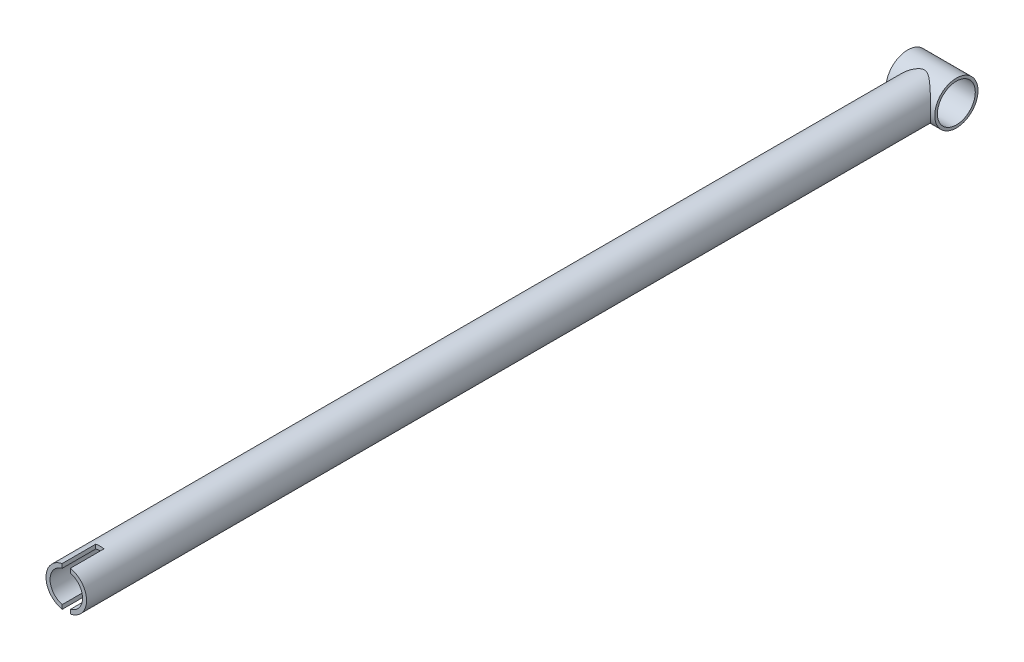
ISO-10303-21;
HEADER;
FILE_DESCRIPTION(('STEP AP214'),'2;1');
FILE_NAME('part.step','',(''),(''),'','','');
FILE_SCHEMA(('AUTOMOTIVE_DESIGN { 1 0 10303 214 1 1 1 1 }'));
ENDSEC;
DATA;
#1=APPLICATION_CONTEXT('core data for automotive mechanical design processes');
#2=APPLICATION_PROTOCOL_DEFINITION('international standard','automotive_design',2000,#1);
#3=PRODUCT_CONTEXT('',#1,'mechanical');
#4=PRODUCT('Part','Part','',(#3));
#5=PRODUCT_RELATED_PRODUCT_CATEGORY('part','',(#4));
#6=PRODUCT_DEFINITION_FORMATION('','',#4);
#7=PRODUCT_DEFINITION_CONTEXT('part definition',#1,'design');
#8=PRODUCT_DEFINITION('design','',#6,#7);
#9=PRODUCT_DEFINITION_SHAPE('','',#8);
#10=(LENGTH_UNIT() NAMED_UNIT(*) SI_UNIT(.MILLI.,.METRE.));
#11=(NAMED_UNIT(*) PLANE_ANGLE_UNIT() SI_UNIT($,.RADIAN.));
#12=(NAMED_UNIT(*) SI_UNIT($,.STERADIAN.) SOLID_ANGLE_UNIT());
#13=UNCERTAINTY_MEASURE_WITH_UNIT(LENGTH_MEASURE(1.E-05),#10,'distance_accuracy_value','');
#14=(GEOMETRIC_REPRESENTATION_CONTEXT(3) GLOBAL_UNCERTAINTY_ASSIGNED_CONTEXT((#13)) GLOBAL_UNIT_ASSIGNED_CONTEXT((#10,
#11,#12)) REPRESENTATION_CONTEXT('',''));
#15=CARTESIAN_POINT('',(0.,0.,0.));
#16=DIRECTION('',(0.,0.,1.));
#17=DIRECTION('',(1.,0.,0.));
#18=AXIS2_PLACEMENT_3D('',#15,#16,#17);
#19=CARTESIAN_POINT('',(0.,0.,1016.));
#20=DIRECTION('',(0.,0.,-1.));
#21=DIRECTION('',(-1.,0.,0.));
#22=AXIS2_PLACEMENT_3D('',#19,#20,#21);
#23=CYLINDRICAL_SURFACE('',#22,23.8125);
#24=CARTESIAN_POINT('',(0.,0.,976.63));
#25=DIRECTION('',(0.,0.,-1.));
#26=DIRECTION('',(-1.,0.,0.));
#27=AXIS2_PLACEMENT_3D('',#24,#25,#26);
#28=CIRCLE('',#27,23.8125);
#29=CARTESIAN_POINT('',(4.826,-23.3183378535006,976.63));
#30=VERTEX_POINT('',#29);
#31=CARTESIAN_POINT('',(-4.826,-23.3183378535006,976.63));
#32=VERTEX_POINT('',#31);
#33=EDGE_CURVE('E98',#30,#32,#28,.T.);
#34=ORIENTED_EDGE('',*,*,#33,.T.);
#35=DIRECTION('',(0.,0.,-1.));
#36=VECTOR('',#35,1.);
#37=CARTESIAN_POINT('',(-4.826,-23.3183378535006,1016.));
#38=LINE('',#37,#36);
#39=CARTESIAN_POINT('',(-4.826,-23.3183378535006,1016.));
#40=VERTEX_POINT('',#39);
#41=EDGE_CURVE('E128',#32,#40,#38,.F.);
#42=ORIENTED_EDGE('',*,*,#41,.T.);
#43=CARTESIAN_POINT('',(0.,0.,1016.));
#44=DIRECTION('',(0.,0.,1.));
#45=DIRECTION('',(1.,0.,0.));
#46=AXIS2_PLACEMENT_3D('',#43,#44,#45);
#47=CIRCLE('',#46,23.8125);
#48=CARTESIAN_POINT('',(-4.826,23.3183378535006,1016.));
#49=VERTEX_POINT('',#48);
#50=EDGE_CURVE('E139',#49,#40,#47,.T.);
#51=ORIENTED_EDGE('',*,*,#50,.F.);
#52=DIRECTION('',(0.,0.,-1.));
#53=VECTOR('',#52,1.);
#54=CARTESIAN_POINT('',(-4.826,23.3183378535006,1016.));
#55=LINE('',#54,#53);
#56=CARTESIAN_POINT('',(-4.826,23.3183378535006,976.63));
#57=VERTEX_POINT('',#56);
#58=EDGE_CURVE('E131',#49,#57,#55,.T.);
#59=ORIENTED_EDGE('',*,*,#58,.T.);
#60=CARTESIAN_POINT('',(4.826,23.3183378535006,976.63));
#61=VERTEX_POINT('',#60);
#62=EDGE_CURVE('E108',#57,#61,#28,.T.);
#63=ORIENTED_EDGE('',*,*,#62,.T.);
#64=DIRECTION('',(0.,0.,-1.));
#65=VECTOR('',#64,1.);
#66=CARTESIAN_POINT('',(4.826,23.3183378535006,1016.));
#67=LINE('',#66,#65);
#68=CARTESIAN_POINT('',(4.826,23.3183378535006,1016.));
#69=VERTEX_POINT('',#68);
#70=EDGE_CURVE('E121',#61,#69,#67,.F.);
#71=ORIENTED_EDGE('',*,*,#70,.T.);
#72=CARTESIAN_POINT('',(4.826,-23.3183378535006,1016.));
#73=VERTEX_POINT('',#72);
#74=EDGE_CURVE('E119',#73,#69,#47,.T.);
#75=ORIENTED_EDGE('',*,*,#74,.F.);
#76=DIRECTION('',(0.,0.,-1.));
#77=VECTOR('',#76,1.);
#78=CARTESIAN_POINT('',(4.826,-23.3183378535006,1016.));
#79=LINE('',#78,#77);
#80=EDGE_CURVE('E109',#73,#30,#79,.T.);
#81=ORIENTED_EDGE('',*,*,#80,.T.);
#82=EDGE_LOOP('',(#34,#42,#51,#59,#63,#71,#75,#81));
#83=FACE_BOUND('',#82,.T.);
#84=CARTESIAN_POINT('',(-23.8125,0.,25.4));
#85=CARTESIAN_POINT('',(-23.8124945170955,0.5433699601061,25.3999945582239));
#86=CARTESIAN_POINT('',(-23.7938585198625,1.08695240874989,25.3825210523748));
#87=CARTESIAN_POINT('',(-23.7196691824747,2.16962719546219,25.3129885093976));
#88=CARTESIAN_POINT('',(-23.6640891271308,2.70871599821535,25.2609044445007));
#89=CARTESIAN_POINT('',(-23.5169409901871,3.77904353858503,25.1231106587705));
#90=CARTESIAN_POINT('',(-23.4252799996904,4.31025830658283,25.0373141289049));
#91=CARTESIAN_POINT('',(-23.2077627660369,5.35927877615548,24.8339205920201));
#92=CARTESIAN_POINT('',(-23.0819119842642,5.8770866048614,24.7163286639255));
#93=CARTESIAN_POINT('',(-22.7992557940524,6.89237236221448,24.4525734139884));
#94=CARTESIAN_POINT('',(-22.6426810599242,7.38997032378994,24.306623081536));
#95=CARTESIAN_POINT('',(-22.3004255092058,8.36622835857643,23.9881199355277));
#96=CARTESIAN_POINT('',(-22.1147441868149,8.84488810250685,23.8155666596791));
#97=CARTESIAN_POINT('',(-21.7168943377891,9.78111762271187,23.4465948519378));
#98=CARTESIAN_POINT('',(-21.5047407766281,10.2386991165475,23.2501898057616));
#99=CARTESIAN_POINT('',(-21.0562452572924,11.1319137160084,22.8360001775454));
#100=CARTESIAN_POINT('',(-20.8198977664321,11.5675417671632,22.6182107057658));
#101=CARTESIAN_POINT('',(-20.398848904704,12.2898845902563,22.2313557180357));
#102=CARTESIAN_POINT('',(-20.2196596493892,12.5823965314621,22.0670329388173));
#103=CARTESIAN_POINT('',(-19.8512712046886,13.1559236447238,21.7299860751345));
#104=CARTESIAN_POINT('',(-19.662074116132,13.4369412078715,21.5572637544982));
#105=CARTESIAN_POINT('',(-19.0802863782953,14.262943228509,21.0275146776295));
#106=CARTESIAN_POINT('',(-18.6735737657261,14.7907501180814,20.6589744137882));
#107=CARTESIAN_POINT('',(-17.826255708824,15.8017829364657,19.8963819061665));
#108=CARTESIAN_POINT('',(-17.3855514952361,16.2848692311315,19.5022558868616));
#109=CARTESIAN_POINT('',(-16.4750079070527,17.205474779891,18.6950850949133));
#110=CARTESIAN_POINT('',(-16.0051714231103,17.6429985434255,18.2820422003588));
#111=CARTESIAN_POINT('',(-15.2152157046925,18.3220124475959,17.595586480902));
#112=CARTESIAN_POINT('',(-14.9029540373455,18.5768229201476,17.3261612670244));
#113=CARTESIAN_POINT('',(-14.2681586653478,19.0687187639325,16.7832683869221));
#114=CARTESIAN_POINT('',(-13.9456253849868,19.3058048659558,16.5098008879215));
#115=CARTESIAN_POINT('',(-13.2902888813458,19.7626683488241,15.9600990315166));
#116=CARTESIAN_POINT('',(-12.9574780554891,19.9824324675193,15.6838627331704));
#117=CARTESIAN_POINT('',(-12.2818366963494,20.40466467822,15.1304583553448));
#118=CARTESIAN_POINT('',(-11.9390065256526,20.6071333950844,14.8532903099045));
#119=CARTESIAN_POINT('',(-11.2439339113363,20.9944518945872,14.3005791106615));
#120=CARTESIAN_POINT('',(-10.8917172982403,21.1793446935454,14.0250336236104));
#121=CARTESIAN_POINT('',(-10.1764303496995,21.532173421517,13.4770793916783));
#122=CARTESIAN_POINT('',(-9.81335887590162,21.7001075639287,13.2046709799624));
#123=CARTESIAN_POINT('',(-9.07584838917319,22.0187496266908,12.6661915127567));
#124=CARTESIAN_POINT('',(-8.70142284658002,22.1694770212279,12.400113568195));
#125=CARTESIAN_POINT('',(-7.93944983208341,22.4536333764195,11.877819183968));
#126=CARTESIAN_POINT('',(-7.55190632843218,22.5870675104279,11.6215998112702));
#127=CARTESIAN_POINT('',(-6.88132426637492,22.7983739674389,11.1996341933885));
#128=CARTESIAN_POINT('',(-6.60218570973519,22.8808339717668,11.0299903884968));
#129=CARTESIAN_POINT('',(-6.03568161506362,23.0367545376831,10.7005196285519));
#130=CARTESIAN_POINT('',(-5.7483160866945,23.110215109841,10.5406926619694));
#131=CARTESIAN_POINT('',(-5.16465858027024,23.2476063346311,10.2341091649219));
#132=CARTESIAN_POINT('',(-4.86837337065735,23.3115440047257,10.0873430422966));
#133=CARTESIAN_POINT('',(-4.26610720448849,23.4292506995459,9.81085060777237));
#134=CARTESIAN_POINT('',(-3.96012806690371,23.483021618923,9.68112112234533));
#135=CARTESIAN_POINT('',(-3.15568301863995,23.6077323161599,9.37423315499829));
#136=CARTESIAN_POINT('',(-2.64911932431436,23.6703713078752,9.21359493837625));
#137=CARTESIAN_POINT('',(-1.87405572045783,23.7400579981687,9.03182559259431));
#138=CARTESIAN_POINT('',(-1.61345016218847,23.7592340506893,8.98112306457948));
#139=CARTESIAN_POINT('',(-1.08834556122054,23.7890669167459,8.90180385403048));
#140=CARTESIAN_POINT('',(-0.823846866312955,23.7997244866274,8.87318521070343));
#141=CARTESIAN_POINT('',(-0.290962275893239,23.8122260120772,8.83958334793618));
#142=CARTESIAN_POINT('',(-0.0225622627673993,23.8139975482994,8.8347943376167));
#143=CARTESIAN_POINT('',(0.513456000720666,23.8084724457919,8.84967205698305));
#144=CARTESIAN_POINT('',(0.781074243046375,23.8011757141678,8.86933903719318));
#145=CARTESIAN_POINT('',(1.31366141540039,23.777734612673,8.93198934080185));
#146=CARTESIAN_POINT('',(1.57862413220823,23.7615729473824,8.9750182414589));
#147=CARTESIAN_POINT('',(2.10358927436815,23.720865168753,9.08205988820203));
#148=CARTESIAN_POINT('',(2.36359072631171,23.6963174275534,9.1460767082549));
#149=CARTESIAN_POINT('',(2.98270446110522,23.6277666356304,9.3220598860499));
#150=CARTESIAN_POINT('',(3.33885280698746,23.5799127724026,9.44292853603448));
#151=CARTESIAN_POINT('',(4.03828437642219,23.4702569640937,9.71226730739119));
#152=CARTESIAN_POINT('',(4.38155978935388,23.4084467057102,9.86075387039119));
#153=CARTESIAN_POINT('',(5.05698426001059,23.2718972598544,10.1788441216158));
#154=CARTESIAN_POINT('',(5.38908780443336,23.197111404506,10.3485233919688));
#155=CARTESIAN_POINT('',(6.04196869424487,23.0356861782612,10.7030425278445));
#156=CARTESIAN_POINT('',(6.36274751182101,22.9490483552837,10.8878804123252));
#157=CARTESIAN_POINT('',(7.02456472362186,22.7556723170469,11.2868556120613));
#158=CARTESIAN_POINT('',(7.36459862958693,22.6478034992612,11.5021032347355));
#159=CARTESIAN_POINT('',(8.03416279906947,22.4190221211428,11.9418987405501));
#160=CARTESIAN_POINT('',(8.36369061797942,22.2981065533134,12.1664487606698));
#161=CARTESIAN_POINT('',(9.01358596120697,22.043418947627,12.6220388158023));
#162=CARTESIAN_POINT('',(9.33394547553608,21.9096360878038,12.8530841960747));
#163=CARTESIAN_POINT('',(9.96603509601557,21.6294426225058,13.3192031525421));
#164=CARTESIAN_POINT('',(10.2777658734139,21.4830330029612,13.5542764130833));
#165=CARTESIAN_POINT('',(10.893678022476,21.177377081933,14.0270471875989));
#166=CARTESIAN_POINT('',(11.1978475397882,21.0181121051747,14.2647480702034));
#167=CARTESIAN_POINT('',(11.7985327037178,20.686889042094,14.7409906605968));
#168=CARTESIAN_POINT('',(12.0950478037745,20.5149300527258,14.979532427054));
#169=CARTESIAN_POINT('',(12.9731667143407,19.9800435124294,15.6943212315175));
#170=CARTESIAN_POINT('',(13.5436968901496,19.5979312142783,16.1700059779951));
#171=CARTESIAN_POINT('',(14.7105106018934,18.7406279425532,17.1586427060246));
#172=CARTESIAN_POINT('',(15.3036530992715,18.2599481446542,17.6705573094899));
#173=CARTESIAN_POINT('',(16.4510040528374,17.2334649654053,18.6730477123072));
#174=CARTESIAN_POINT('',(17.0051997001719,16.6876403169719,19.1636164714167));
#175=CARTESIAN_POINT('',(18.0675825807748,15.5309967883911,20.112323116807));
#176=CARTESIAN_POINT('',(18.5759087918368,14.9203873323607,20.5705579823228));
#177=CARTESIAN_POINT('',(19.2992532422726,13.9547698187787,21.2267717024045));
#178=CARTESIAN_POINT('',(19.5337945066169,13.6246949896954,21.4402743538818));
#179=CARTESIAN_POINT('',(19.9888732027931,12.9478352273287,21.8556912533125));
#180=CARTESIAN_POINT('',(20.209407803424,12.6010469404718,22.0576031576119));
#181=CARTESIAN_POINT('',(20.6881364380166,11.8026841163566,22.4969483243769));
#182=CARTESIAN_POINT('',(20.9420517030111,11.3465026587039,22.7307233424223));
#183=CARTESIAN_POINT('',(21.4232376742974,10.4094822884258,23.174800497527));
#184=CARTESIAN_POINT('',(21.6505165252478,9.92865097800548,23.3851098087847));
#185=CARTESIAN_POINT('',(22.0755878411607,8.94377393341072,23.7791942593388));
#186=CARTESIAN_POINT('',(22.2733900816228,8.43973596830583,23.9629781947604));
#187=CARTESIAN_POINT('',(22.6366581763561,7.41044354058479,24.3010022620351));
#188=CARTESIAN_POINT('',(22.8021230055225,6.88518840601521,24.4552414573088));
#189=CARTESIAN_POINT('',(23.099132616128,5.81187341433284,24.7324057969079));
#190=CARTESIAN_POINT('',(23.2303738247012,5.26365642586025,24.855050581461));
#191=CARTESIAN_POINT('',(23.4544566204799,4.15267148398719,25.0646125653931));
#192=CARTESIAN_POINT('',(23.5472982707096,3.58990355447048,25.151529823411));
#193=CARTESIAN_POINT('',(23.6925149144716,2.45498481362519,25.287535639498));
#194=CARTESIAN_POINT('',(23.7449153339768,1.88284012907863,25.3366479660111));
#195=CARTESIAN_POINT('',(23.8081217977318,0.73427365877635,25.3958930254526));
#196=CARTESIAN_POINT('',(23.8189328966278,0.15785240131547,25.4060304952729));
#197=CARTESIAN_POINT('',(23.7999919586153,-0.921861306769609,25.3882740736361));
#198=CARTESIAN_POINT('',(23.7751205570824,-1.42532715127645,25.3649561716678));
#199=CARTESIAN_POINT('',(23.6937865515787,-2.42739693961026,25.2887358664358));
#200=CARTESIAN_POINT('',(23.6373270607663,-2.92600135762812,25.2358363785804));
#201=CARTESIAN_POINT('',(23.4937978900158,-3.91488205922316,25.1014491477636));
#202=CARTESIAN_POINT('',(23.4067260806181,-4.40515776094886,25.0199594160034));
#203=CARTESIAN_POINT('',(23.2034000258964,-5.37424760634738,24.8298473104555));
#204=CARTESIAN_POINT('',(23.0871445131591,-5.85306125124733,24.7212237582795));
#205=CARTESIAN_POINT('',(22.8274576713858,-6.79565141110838,24.4788785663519));
#206=CARTESIAN_POINT('',(22.6840797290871,-7.25945540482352,24.3452062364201));
#207=CARTESIAN_POINT('',(22.3719405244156,-8.17089338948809,24.0546319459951));
#208=CARTESIAN_POINT('',(22.2031801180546,-8.61852792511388,23.8977307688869));
#209=CARTESIAN_POINT('',(21.8422656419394,-9.49608862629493,23.562786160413));
#210=CARTESIAN_POINT('',(21.6501105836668,-9.9260140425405,23.3847418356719));
#211=CARTESIAN_POINT('',(21.2443730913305,-10.7670740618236,23.0096123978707));
#212=CARTESIAN_POINT('',(21.0307861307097,-11.1782046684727,22.8125232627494));
#213=CARTESIAN_POINT('',(20.4765103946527,-12.1741782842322,22.3023660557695));
#214=CARTESIAN_POINT('',(20.1241315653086,-12.7473718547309,21.9791392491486));
#215=CARTESIAN_POINT('',(19.3820402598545,-13.8496770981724,21.301768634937));
#216=CARTESIAN_POINT('',(18.9923129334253,-14.3787710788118,20.9476125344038));
#217=CARTESIAN_POINT('',(18.1790931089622,-15.3941562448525,20.2132038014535));
#218=CARTESIAN_POINT('',(17.755504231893,-15.8803163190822,19.8328771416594));
#219=CARTESIAN_POINT('',(16.8794582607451,-16.8085196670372,19.052595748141));
#220=CARTESIAN_POINT('',(16.4270034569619,-17.2505664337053,18.6526425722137));
#221=CARTESIAN_POINT('',(15.3583333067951,-18.2158613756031,17.7177051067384));
#222=CARTESIAN_POINT('',(14.7332252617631,-18.7245221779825,17.177733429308));
#223=CARTESIAN_POINT('',(13.7653720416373,-19.4347582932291,16.3579101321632));
#224=CARTESIAN_POINT('',(13.4375683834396,-19.6628017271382,16.0828656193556));
#225=CARTESIAN_POINT('',(12.7719402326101,-20.1015325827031,15.5310192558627));
#226=CARTESIAN_POINT('',(12.4341160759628,-20.3122205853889,15.2542174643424));
#227=CARTESIAN_POINT('',(11.7491708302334,-20.7159314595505,14.7012618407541));
#228=CARTESIAN_POINT('',(11.4020735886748,-20.9089948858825,14.425108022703));
#229=CARTESIAN_POINT('',(10.6973624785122,-21.2781542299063,13.8747939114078));
#230=CARTESIAN_POINT('',(10.339747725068,-21.4542487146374,13.6006337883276));
#231=CARTESIAN_POINT('',(9.6136125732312,-21.7892945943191,13.0571223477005));
#232=CARTESIAN_POINT('',(9.24510297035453,-21.9482622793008,12.7877666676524));
#233=CARTESIAN_POINT('',(8.49571918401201,-22.2490663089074,12.2569163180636));
#234=CARTESIAN_POINT('',(8.11484803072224,-22.3909068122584,11.9954197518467));
#235=CARTESIAN_POINT('',(7.44996050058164,-22.6189941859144,11.5578293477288));
#236=CARTESIAN_POINT('',(7.16941089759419,-22.709535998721,11.378706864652));
#237=CARTESIAN_POINT('',(6.60028948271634,-22.881427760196,11.0289709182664));
#238=CARTESIAN_POINT('',(6.31171795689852,-22.9627780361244,10.85835715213));
#239=CARTESIAN_POINT('',(5.72555988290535,-23.115899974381,10.5284479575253));
#240=CARTESIAN_POINT('',(5.42797231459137,-23.1876705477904,10.3691538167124));
#241=CARTESIAN_POINT('',(4.8230653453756,-23.3210044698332,10.0656974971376));
#242=CARTESIAN_POINT('',(4.51574706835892,-23.3825689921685,9.92153357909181));
#243=CARTESIAN_POINT('',(3.68853236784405,-23.530882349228,9.56632570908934));
#244=CARTESIAN_POINT('',(3.15920521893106,-23.6083128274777,9.37200982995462));
#245=CARTESIAN_POINT('',(2.34607034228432,-23.6982124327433,9.14120759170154));
#246=CARTESIAN_POINT('',(2.07221757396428,-23.7237876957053,9.07443489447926));
#247=CARTESIAN_POINT('',(1.5190553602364,-23.7656151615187,8.96431828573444));
#248=CARTESIAN_POINT('',(1.23974657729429,-23.7818684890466,8.92097154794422));
#249=CARTESIAN_POINT('',(0.67424679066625,-23.8046555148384,8.8599939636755));
#250=CARTESIAN_POINT('',(0.388013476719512,-23.8110614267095,8.84270126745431));
#251=CARTESIAN_POINT('',(-0.184815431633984,-23.8135050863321,8.83611838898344));
#252=CARTESIAN_POINT('',(-0.471411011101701,-23.8095432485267,8.84682708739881));
#253=CARTESIAN_POINT('',(-1.0424207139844,-23.7913909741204,8.89552509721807));
#254=CARTESIAN_POINT('',(-1.32682999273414,-23.7771821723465,8.93356338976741));
#255=CARTESIAN_POINT('',(-1.89051363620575,-23.7390184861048,9.03448255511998));
#256=CARTESIAN_POINT('',(-2.16978670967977,-23.7150611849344,9.09736958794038));
#257=CARTESIAN_POINT('',(-2.79711127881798,-23.6502880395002,9.2646602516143));
#258=CARTESIAN_POINT('',(-3.14308465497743,-23.6066534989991,9.3757144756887));
#259=CARTESIAN_POINT('',(-3.82303867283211,-23.5061234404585,9.6249762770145));
#260=CARTESIAN_POINT('',(-4.15701380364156,-23.4492219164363,9.76319614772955));
#261=CARTESIAN_POINT('',(-4.81446778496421,-23.3231325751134,10.0606999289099));
#262=CARTESIAN_POINT('',(-5.13790274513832,-23.2538996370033,10.2200606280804));
#263=CARTESIAN_POINT('',(-5.77392229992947,-23.104192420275,10.5541373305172));
#264=CARTESIAN_POINT('',(-6.08650783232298,-23.0237191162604,10.7288520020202));
#265=CARTESIAN_POINT('',(-6.73075133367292,-22.8441278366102,11.1064625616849));
#266=CARTESIAN_POINT('',(-7.06146527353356,-22.7439705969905,11.3104666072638));
#267=CARTESIAN_POINT('',(-7.71276815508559,-22.5314383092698,11.7281390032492));
#268=CARTESIAN_POINT('',(-8.03335466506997,-22.4190603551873,11.9418096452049));
#269=CARTESIAN_POINT('',(-8.66571081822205,-22.1823055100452,12.3760472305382));
#270=CARTESIAN_POINT('',(-8.97747263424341,-22.0579183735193,12.5966199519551));
#271=CARTESIAN_POINT('',(-9.59271692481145,-21.7973969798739,13.0422434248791));
#272=CARTESIAN_POINT('',(-9.89620006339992,-21.6612636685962,13.2672938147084));
#273=CARTESIAN_POINT('',(-10.4959534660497,-21.3770994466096,13.7204682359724));
#274=CARTESIAN_POINT('',(-10.7922130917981,-21.2290522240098,13.9485961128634));
#275=CARTESIAN_POINT('',(-11.3774971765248,-20.921209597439,14.4062170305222));
#276=CARTESIAN_POINT('',(-11.666521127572,-20.761413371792,14.6357101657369));
#277=CARTESIAN_POINT('',(-12.5228715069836,-20.2644685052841,15.3242088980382));
#278=CARTESIAN_POINT('',(-13.0798194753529,-19.9096009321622,15.7834964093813));
#279=CARTESIAN_POINT('',(-14.2300698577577,-19.1072749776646,16.7484618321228));
#280=CARTESIAN_POINT('',(-14.8199565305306,-18.6538367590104,17.2532508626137));
#281=CARTESIAN_POINT('',(-15.9635205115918,-17.6850978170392,18.2449439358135));
#282=CARTESIAN_POINT('',(-16.5171864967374,-17.1697778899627,18.7318423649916));
#283=CARTESIAN_POINT('',(-17.5822861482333,-16.0772760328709,19.6774456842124));
#284=CARTESIAN_POINT('',(-18.0938295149,-15.5002644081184,20.1362229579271));
#285=CARTESIAN_POINT('',(-19.069763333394,-14.2824149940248,21.0175376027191));
#286=CARTESIAN_POINT('',(-19.5341827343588,-13.6416168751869,21.4400971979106));
#287=CARTESIAN_POINT('',(-20.256638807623,-12.5291284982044,22.1007460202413));
#288=CARTESIAN_POINT('',(-20.5305316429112,-12.0755304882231,22.3521181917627));
#289=CARTESIAN_POINT('',(-21.0518952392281,-11.141756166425,22.8319232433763));
#290=CARTESIAN_POINT('',(-21.2993689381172,-10.6615828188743,23.0603586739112));
#291=CARTESIAN_POINT('',(-21.7648497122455,-9.67591204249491,23.4909710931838));
#292=CARTESIAN_POINT('',(-21.982866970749,-9.17042344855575,23.6931571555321));
#293=CARTESIAN_POINT('',(-22.2854126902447,-8.39479637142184,23.9742169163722));
#294=CARTESIAN_POINT('',(-22.3821793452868,-8.13336102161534,24.0641985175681));
#295=CARTESIAN_POINT('',(-22.5672144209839,-7.60489253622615,24.2363954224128));
#296=CARTESIAN_POINT('',(-22.6554805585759,-7.33785792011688,24.3186086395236));
#297=CARTESIAN_POINT('',(-22.8849645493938,-6.59956689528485,24.5325019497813));
#298=CARTESIAN_POINT('',(-23.0171847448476,-6.12303950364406,24.6559094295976));
#299=CARTESIAN_POINT('',(-23.2527104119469,-5.15691737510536,24.8759245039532));
#300=CARTESIAN_POINT('',(-23.3560207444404,-4.66732485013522,24.9725366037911));
#301=CARTESIAN_POINT('',(-23.5319114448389,-3.67907804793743,25.1371187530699));
#302=CARTESIAN_POINT('',(-23.6045617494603,-3.18044712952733,25.2051539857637));
#303=CARTESIAN_POINT('',(-23.7181815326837,-2.17665969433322,25.311589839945));
#304=CARTESIAN_POINT('',(-23.7591703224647,-1.67150734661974,25.3500085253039));
#305=CARTESIAN_POINT('',(-23.7934823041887,-0.971138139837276,25.3821716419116));
#306=CARTESIAN_POINT('',(-23.8006106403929,-0.777055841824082,25.3888540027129));
#307=CARTESIAN_POINT('',(-23.8101206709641,-0.388658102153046,25.3977693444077));
#308=CARTESIAN_POINT('',(-23.8125019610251,-0.194342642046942,25.4000019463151));
#309=CARTESIAN_POINT('',(-23.8125,0.,25.4));
#310=B_SPLINE_CURVE_WITH_KNOTS('',3,(#84,#85,#86,#87,#88,#89,#90,#91,#92,#93,#94,#95,#96,#97,
#98,#99,#100,#101,#102,#103,#104,#105,#106,#107,#108,#109,#110,#111,#112,#113,#114,#115,#116,
#117,#118,#119,#120,#121,#122,#123,#124,#125,#126,#127,#128,#129,#130,#131,#132,#133,#134,#135,
#136,#137,#138,#139,#140,#141,#142,#143,#144,#145,#146,#147,#148,#149,#150,#151,#152,#153,#154,
#155,#156,#157,#158,#159,#160,#161,#162,#163,#164,#165,#166,#167,#168,#169,#170,#171,#172,#173,
#174,#175,#176,#177,#178,#179,#180,#181,#182,#183,#184,#185,#186,#187,#188,#189,#190,#191,#192,
#193,#194,#195,#196,#197,#198,#199,#200,#201,#202,#203,#204,#205,#206,#207,#208,#209,#210,#211,
#212,#213,#214,#215,#216,#217,#218,#219,#220,#221,#222,#223,#224,#225,#226,#227,#228,#229,#230,
#231,#232,#233,#234,#235,#236,#237,#238,#239,#240,#241,#242,#243,#244,#245,#246,#247,#248,#249,
#250,#251,#252,#253,#254,#255,#256,#257,#258,#259,#260,#261,#262,#263,#264,#265,#266,#267,#268,
#269,#270,#271,#272,#273,#274,#275,#276,#277,#278,#279,#280,#281,#282,#283,#284,#285,#286,#287,
#288,#289,#290,#291,#292,#293,#294,#295,#296,#297,#298,#299,#300,#301,#302,#303,#304,#305,#306,
#307,#308,#309),.UNSPECIFIED.,.T.,.F.,(4,2,2,2,2,2,2,2,2,2,2,2,2,2,2,2,2,2,2,2,2,2,2,2,2,2,2,2,
2,2,2,2,2,2,2,2,2,2,2,2,2,2,2,2,2,2,2,2,2,2,2,2,2,2,2,2,2,2,2,2,2,2,2,2,2,2,2,2,2,2,2,2,2,2,2,2,
2,2,2,2,2,2,2,2,2,2,2,2,2,2,2,2,2,2,2,2,2,2,2,2,2,2,2,2,2,2,2,2,2,2,2,2,4),(0.,1.62988438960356,
3.26094867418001,4.89624073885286,6.53127173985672,8.15446681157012,9.77769009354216,
11.3999998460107,13.0226814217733,14.1633710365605,15.3038221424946,17.5852096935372,
19.8734959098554,22.161555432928,23.6155352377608,25.0694550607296,26.5244774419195,
27.9794472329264,29.4307590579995,30.8822236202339,32.332028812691,33.7813992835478,
34.7917771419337,35.8021538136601,36.811782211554,37.82122227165,39.4199209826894,
40.2175748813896,41.0151579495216,41.8192307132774,42.6233117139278,43.4289670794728,
44.2347789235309,45.3702172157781,46.5063336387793,47.6466242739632,48.7867661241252,
50.0361712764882,51.2858650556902,52.5366192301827,53.7872758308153,55.039783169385,
56.2923796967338,58.796136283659,61.5505820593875,64.3059295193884,67.0526267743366,
68.4253445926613,69.7983390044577,71.5128777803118,73.2268909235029,74.9403343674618,
76.6538321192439,78.3820483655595,80.1102617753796,81.8373877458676,83.5643037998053,
85.076305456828,86.5881581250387,88.1001159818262,89.6121395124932,91.1212172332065,
92.6302440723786,94.139334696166,95.6487447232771,97.8847625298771,100.121673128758,
102.365194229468,104.608537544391,107.514573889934,108.968899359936,110.423176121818,
111.87401742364,113.324981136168,114.774552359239,116.223770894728,117.258351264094,
118.292894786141,119.327555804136,120.36209775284,122.062961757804,122.911104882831,
123.759145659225,124.618100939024,125.477021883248,126.337486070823,127.198163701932,
128.294223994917,129.390781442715,130.491436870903,131.591996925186,132.795308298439,
133.998906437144,135.203540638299,136.408077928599,137.614293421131,138.820593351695,
141.231811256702,143.926296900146,146.62162089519,149.309687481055,151.996092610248,
153.754081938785,155.511875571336,157.269059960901,158.147612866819,159.026401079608,
160.553762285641,162.08086652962,163.604468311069,165.127140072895,165.710037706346,
166.292984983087),.UNSPECIFIED.);
#311=CARTESIAN_POINT('',(-23.8125,0.,25.4));
#312=VERTEX_POINT('',#311);
#313=EDGE_CURVE('E11',#312,#312,#310,.T.);
#314=ORIENTED_EDGE('',*,*,#313,.F.);
#315=EDGE_LOOP('',(#314));
#316=FACE_BOUND('',#315,.T.);
#317=ADVANCED_FACE('F26',(#83,#316),#23,.T.);
#318=CARTESIAN_POINT('',(0.,0.,1016.));
#319=DIRECTION('',(0.,0.,-1.));
#320=DIRECTION('',(-1.,0.,0.));
#321=AXIS2_PLACEMENT_3D('',#318,#319,#320);
#322=CYLINDRICAL_SURFACE('',#321,19.05);
#323=DIRECTION('',(0.,0.,-1.));
#324=VECTOR('',#323,1.);
#325=CARTESIAN_POINT('',(-4.826,-18.4285708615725,1016.));
#326=LINE('',#325,#324);
#327=CARTESIAN_POINT('',(-4.826,-18.4285708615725,976.63));
#328=VERTEX_POINT('',#327);
#329=CARTESIAN_POINT('',(-4.826,-18.4285708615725,1016.));
#330=VERTEX_POINT('',#329);
#331=EDGE_CURVE('E39',#328,#330,#326,.F.);
#332=ORIENTED_EDGE('',*,*,#331,.F.);
#333=CARTESIAN_POINT('',(0.,0.,976.63));
#334=DIRECTION('',(0.,0.,-1.));
#335=DIRECTION('',(-1.,0.,0.));
#336=AXIS2_PLACEMENT_3D('',#333,#334,#335);
#337=CIRCLE('',#336,19.05);
#338=CARTESIAN_POINT('',(4.826,-18.4285708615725,976.63));
#339=VERTEX_POINT('',#338);
#340=EDGE_CURVE('E145',#339,#328,#337,.T.);
#341=ORIENTED_EDGE('',*,*,#340,.F.);
#342=DIRECTION('',(0.,0.,-1.));
#343=VECTOR('',#342,1.);
#344=CARTESIAN_POINT('',(4.826,-18.4285708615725,1016.));
#345=LINE('',#344,#343);
#346=CARTESIAN_POINT('',(4.826,-18.4285708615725,1016.));
#347=VERTEX_POINT('',#346);
#348=EDGE_CURVE('E112',#347,#339,#345,.T.);
#349=ORIENTED_EDGE('',*,*,#348,.F.);
#350=CARTESIAN_POINT('',(0.,0.,1016.));
#351=DIRECTION('',(0.,0.,1.));
#352=DIRECTION('',(1.,0.,0.));
#353=AXIS2_PLACEMENT_3D('',#350,#351,#352);
#354=CIRCLE('',#353,19.05);
#355=CARTESIAN_POINT('',(4.826,18.4285708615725,1016.));
#356=VERTEX_POINT('',#355);
#357=EDGE_CURVE('E134',#347,#356,#354,.T.);
#358=ORIENTED_EDGE('',*,*,#357,.T.);
#359=DIRECTION('',(0.,0.,-1.));
#360=VECTOR('',#359,1.);
#361=CARTESIAN_POINT('',(4.826,18.4285708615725,1016.));
#362=LINE('',#361,#360);
#363=CARTESIAN_POINT('',(4.826,18.4285708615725,976.63));
#364=VERTEX_POINT('',#363);
#365=EDGE_CURVE('E140',#364,#356,#362,.F.);
#366=ORIENTED_EDGE('',*,*,#365,.F.);
#367=CARTESIAN_POINT('',(-4.826,18.4285708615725,976.63));
#368=VERTEX_POINT('',#367);
#369=EDGE_CURVE('E142',#368,#364,#337,.T.);
#370=ORIENTED_EDGE('',*,*,#369,.F.);
#371=DIRECTION('',(0.,0.,-1.));
#372=VECTOR('',#371,1.);
#373=CARTESIAN_POINT('',(-4.826,18.4285708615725,1016.));
#374=LINE('',#373,#372);
#375=CARTESIAN_POINT('',(-4.826,18.4285708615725,1016.));
#376=VERTEX_POINT('',#375);
#377=EDGE_CURVE('E144',#376,#368,#374,.T.);
#378=ORIENTED_EDGE('',*,*,#377,.F.);
#379=EDGE_CURVE('E137',#376,#330,#354,.T.);
#380=ORIENTED_EDGE('',*,*,#379,.T.);
#381=EDGE_LOOP('',(#332,#341,#349,#358,#366,#370,#378,#380));
#382=FACE_BOUND('',#381,.T.);
#383=CARTESIAN_POINT('',(-19.05,0.,25.4));
#384=CARTESIAN_POINT('',(-19.0499954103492,0.465196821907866,25.3999955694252));
#385=CARTESIAN_POINT('',(-19.0329288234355,0.930510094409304,25.3871888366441));
#386=CARTESIAN_POINT('',(-18.9649290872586,1.85746307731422,25.3362495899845));
#387=CARTESIAN_POINT('',(-18.9139756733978,2.31910042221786,25.2981019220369));
#388=CARTESIAN_POINT('',(-18.778899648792,3.23582090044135,25.1972726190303));
#389=CARTESIAN_POINT('',(-18.6947042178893,3.6908873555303,25.1345371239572));
#390=CARTESIAN_POINT('',(-18.4944970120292,4.59001307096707,24.9859845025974));
#391=CARTESIAN_POINT('',(-18.3784895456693,5.03407381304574,24.900170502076));
#392=CARTESIAN_POINT('',(-18.1171295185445,5.90575235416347,24.7078954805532));
#393=CARTESIAN_POINT('',(-17.9719606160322,6.3334540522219,24.6015638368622));
#394=CARTESIAN_POINT('',(-17.6536660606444,7.17301565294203,24.3700123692));
#395=CARTESIAN_POINT('',(-17.4805395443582,7.58487506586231,24.2447919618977));
#396=CARTESIAN_POINT('',(-17.108306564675,8.39078532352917,23.9777989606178));
#397=CARTESIAN_POINT('',(-16.9092136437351,8.78484530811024,23.8360349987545));
#398=CARTESIAN_POINT('',(-16.4867669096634,9.55414274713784,23.5382356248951));
#399=CARTESIAN_POINT('',(-16.2634095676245,9.92937745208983,23.3821981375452));
#400=CARTESIAN_POINT('',(-15.7724121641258,10.6938555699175,23.0432649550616));
#401=CARTESIAN_POINT('',(-15.5025870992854,11.0811850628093,22.8592199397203));
#402=CARTESIAN_POINT('',(-14.9379075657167,11.8313941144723,22.4800976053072));
#403=CARTESIAN_POINT('',(-14.6430517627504,12.1942723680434,22.2850196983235));
#404=CARTESIAN_POINT('',(-14.0294608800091,12.8955068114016,21.8867244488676));
#405=CARTESIAN_POINT('',(-13.7106928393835,13.2338278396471,21.6834960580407));
#406=CARTESIAN_POINT('',(-13.050864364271,13.8849674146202,21.2724225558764));
#407=CARTESIAN_POINT('',(-12.709802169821,14.1977839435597,21.0645770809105));
#408=CARTESIAN_POINT('',(-11.9347086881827,14.8584878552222,20.6052986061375));
#409=CARTESIAN_POINT('',(-11.4958732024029,15.2005761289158,20.3535947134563));
#410=CARTESIAN_POINT('',(-10.5880345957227,15.8463402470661,19.8549738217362));
#411=CARTESIAN_POINT('',(-10.119022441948,16.1500045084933,19.6080582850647));
#412=CARTESIAN_POINT('',(-9.15168969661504,16.7171470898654,19.1268141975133));
#413=CARTESIAN_POINT('',(-8.65339909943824,16.9806655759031,18.8924732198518));
#414=CARTESIAN_POINT('',(-7.88427540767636,17.3441928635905,18.5571075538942));
#415=CARTESIAN_POINT('',(-7.62433921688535,17.4600573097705,18.4480297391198));
#416=CARTESIAN_POINT('',(-7.09715980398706,17.6809083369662,18.2364701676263));
#417=CARTESIAN_POINT('',(-6.8299149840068,17.7858925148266,18.1339898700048));
#418=CARTESIAN_POINT('',(-6.20372993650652,18.0155349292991,17.90626126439));
#419=CARTESIAN_POINT('',(-5.84221681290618,18.1360988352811,17.7838969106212));
#420=CARTESIAN_POINT('',(-5.1077356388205,18.3564831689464,17.5563274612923));
#421=CARTESIAN_POINT('',(-4.7347713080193,18.4563102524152,17.4511168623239));
#422=CARTESIAN_POINT('',(-3.97915096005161,18.6338172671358,17.2614520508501));
#423=CARTESIAN_POINT('',(-3.59651456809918,18.7115386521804,17.1769590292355));
#424=CARTESIAN_POINT('',(-2.82274949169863,18.8437945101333,17.0317672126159));
#425=CARTESIAN_POINT('',(-2.43162091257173,18.8983292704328,16.9710681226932));
#426=CARTESIAN_POINT('',(-1.63986825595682,18.9834999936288,16.8757487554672));
#427=CARTESIAN_POINT('',(-1.23918989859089,19.0139111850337,16.8413738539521));
#428=CARTESIAN_POINT('',(-0.435268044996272,19.0492756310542,16.8013639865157));
#429=CARTESIAN_POINT('',(-0.0320246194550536,19.0542295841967,16.7957282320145));
#430=CARTESIAN_POINT('',(0.773442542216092,19.03855581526,16.8134922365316));
#431=CARTESIAN_POINT('',(1.17566590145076,19.0179197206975,16.8369014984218));
#432=CARTESIAN_POINT('',(1.97539400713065,18.9515525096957,16.911567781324));
#433=CARTESIAN_POINT('',(2.37289870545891,18.9058211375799,16.9628250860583));
#434=CARTESIAN_POINT('',(3.11788217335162,18.7964750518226,17.0838629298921));
#435=CARTESIAN_POINT('',(3.46614925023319,18.7353080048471,17.1510633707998));
#436=CARTESIAN_POINT('',(4.15502060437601,18.5946768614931,17.3034316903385));
#437=CARTESIAN_POINT('',(4.49562209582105,18.5152062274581,17.3886059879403));
#438=CARTESIAN_POINT('',(5.50442568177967,18.2506697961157,17.6674440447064));
#439=CARTESIAN_POINT('',(6.15956130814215,18.0394893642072,17.8844114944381));
#440=CARTESIAN_POINT('',(7.31063755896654,17.6000887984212,18.3159267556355));
#441=CARTESIAN_POINT('',(7.81346829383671,17.3824061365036,18.5233675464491));
#442=CARTESIAN_POINT('',(8.7923923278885,16.9083417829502,18.9570887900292));
#443=CARTESIAN_POINT('',(9.26847174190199,16.651940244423,19.1833788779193));
#444=CARTESIAN_POINT('',(10.1942044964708,16.1019028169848,19.6473533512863));
#445=CARTESIAN_POINT('',(10.6438009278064,15.8081907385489,19.8850604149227));
#446=CARTESIAN_POINT('',(11.5150953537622,15.1852491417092,20.3647431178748));
#447=CARTESIAN_POINT('',(11.9367977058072,14.8560251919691,20.6067180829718));
#448=CARTESIAN_POINT('',(12.7618631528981,14.1540822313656,21.0952456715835));
#449=CARTESIAN_POINT('',(13.1644943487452,13.7804748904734,21.3417596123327));
#450=CARTESIAN_POINT('',(13.9381727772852,12.9974158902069,21.8274952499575));
#451=CARTESIAN_POINT('',(14.3092168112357,12.5879606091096,22.0667162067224));
#452=CARTESIAN_POINT('',(15.0169238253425,11.7346107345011,22.5320788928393));
#453=CARTESIAN_POINT('',(15.3536439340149,11.2907756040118,22.7582420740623));
#454=CARTESIAN_POINT('',(15.8311084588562,10.5998524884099,23.0839340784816));
#455=CARTESIAN_POINT('',(15.9856519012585,10.3653651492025,23.19023306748));
#456=CARTESIAN_POINT('',(16.2852020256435,9.8880786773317,23.3977268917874));
#457=CARTESIAN_POINT('',(16.4302062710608,9.64527744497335,23.4989204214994));
#458=CARTESIAN_POINT('',(16.7939696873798,9.00392961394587,23.7543576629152));
#459=CARTESIAN_POINT('',(17.0049466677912,8.59911928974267,23.9041152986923));
#460=CARTESIAN_POINT('',(17.3992132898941,7.77047989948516,24.1861770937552));
#461=CARTESIAN_POINT('',(17.582508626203,7.34665476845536,24.3184848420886));
#462=CARTESIAN_POINT('',(17.919339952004,6.48189351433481,24.5631195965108));
#463=CARTESIAN_POINT('',(18.0728870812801,6.04096387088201,24.6754540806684));
#464=CARTESIAN_POINT('',(18.3482645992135,5.14428133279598,24.8778534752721));
#465=CARTESIAN_POINT('',(18.4700945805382,4.68852824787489,24.9679180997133));
#466=CARTESIAN_POINT('',(18.6808497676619,3.76234995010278,25.1242236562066));
#467=CARTESIAN_POINT('',(18.7695646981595,3.29185087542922,25.1903122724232));
#468=CARTESIAN_POINT('',(18.9115068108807,2.34258342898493,25.2962517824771));
#469=CARTESIAN_POINT('',(18.9647339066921,1.86381503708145,25.3361026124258));
#470=CARTESIAN_POINT('',(19.0347225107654,0.902285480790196,25.3885332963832));
#471=CARTESIAN_POINT('',(19.0514961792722,0.419525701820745,25.4011222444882));
#472=CARTESIAN_POINT('',(19.0482946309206,-0.5457803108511,25.3987208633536));
#473=CARTESIAN_POINT('',(19.0283223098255,-1.0283265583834,25.3837327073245));
#474=CARTESIAN_POINT('',(18.9558665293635,-1.94046672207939,25.3294666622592));
#475=CARTESIAN_POINT('',(18.9068600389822,-2.37049899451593,25.2927871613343));
#476=CARTESIAN_POINT('',(18.7801739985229,-3.22391477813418,25.1982272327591));
#477=CARTESIAN_POINT('',(18.7024967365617,-3.64729881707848,25.1403484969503));
#478=CARTESIAN_POINT('',(18.5195241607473,-4.48480794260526,25.0045300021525));
#479=CARTESIAN_POINT('',(18.4142251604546,-4.89893178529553,24.9265875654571));
#480=CARTESIAN_POINT('',(18.1773372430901,-5.7155658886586,24.7521044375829));
#481=CARTESIAN_POINT('',(18.0457470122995,-6.11807556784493,24.6555628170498));
#482=CARTESIAN_POINT('',(17.7526894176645,-6.92347991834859,24.4418713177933));
#483=CARTESIAN_POINT('',(17.5903336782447,-7.32588976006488,24.3241158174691));
#484=CARTESIAN_POINT('',(17.2407467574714,-8.11450646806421,24.0725179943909));
#485=CARTESIAN_POINT('',(17.0535152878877,-8.50071314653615,23.9386754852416));
#486=CARTESIAN_POINT('',(16.6558612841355,-9.25563589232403,23.657039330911));
#487=CARTESIAN_POINT('',(16.4454401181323,-9.62435298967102,23.5092465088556));
#488=CARTESIAN_POINT('',(16.0029383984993,-10.3434393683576,23.2018578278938));
#489=CARTESIAN_POINT('',(15.7708547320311,-10.6938060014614,23.0422602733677));
#490=CARTESIAN_POINT('',(15.245988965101,-11.4324291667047,22.6859990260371));
#491=CARTESIAN_POINT('',(14.9495420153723,-11.8172456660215,22.4875955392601));
#492=CARTESIAN_POINT('',(14.3309644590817,-12.5602427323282,22.0812058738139));
#493=CARTESIAN_POINT('',(14.0088313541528,-12.9184207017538,21.8732187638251));
#494=CARTESIAN_POINT('',(13.339675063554,-13.6083430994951,21.4508023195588));
#495=CARTESIAN_POINT('',(12.9926010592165,-13.9400304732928,21.2363603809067));
#496=CARTESIAN_POINT('',(12.2752464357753,-14.5756824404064,20.8052156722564));
#497=CARTESIAN_POINT('',(11.9049644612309,-14.8796454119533,20.5885127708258));
#498=CARTESIAN_POINT('',(11.0692867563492,-15.514467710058,20.1158183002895));
#499=CARTESIAN_POINT('',(10.5991951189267,-15.8394477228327,19.8601929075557));
#500=CARTESIAN_POINT('',(9.62755774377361,-16.4481422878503,19.3590820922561));
#501=CARTESIAN_POINT('',(9.12600054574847,-16.7318416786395,19.1136004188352));
#502=CARTESIAN_POINT('',(8.09310136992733,-17.2551047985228,18.6425576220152));
#503=CARTESIAN_POINT('',(7.56183335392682,-17.4947722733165,18.4169503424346));
#504=CARTESIAN_POINT('',(6.4693003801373,-17.9274987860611,17.9959967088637));
#505=CARTESIAN_POINT('',(5.90806076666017,-18.1205964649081,17.8006253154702));
#506=CARTESIAN_POINT('',(4.9816391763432,-18.3907530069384,17.5203331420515));
#507=CARTESIAN_POINT('',(4.62509281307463,-18.483734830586,17.4220064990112));
#508=CARTESIAN_POINT('',(3.90270513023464,-18.6496283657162,17.244307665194));
#509=CARTESIAN_POINT('',(3.53686550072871,-18.7225436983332,17.1649320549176));
#510=CARTESIAN_POINT('',(2.79824903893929,-18.8470760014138,17.0281034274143));
#511=CARTESIAN_POINT('',(2.42548708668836,-18.8987341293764,16.97060806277));
#512=CARTESIAN_POINT('',(1.67461638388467,-18.9800086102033,16.8796629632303));
#513=CARTESIAN_POINT('',(1.29650761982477,-19.0096249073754,16.8462132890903));
#514=CARTESIAN_POINT('',(0.535824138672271,-19.0462887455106,16.8047515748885));
#515=CARTESIAN_POINT('',(0.153236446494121,-19.0532191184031,16.7968715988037));
#516=CARTESIAN_POINT('',(-0.611289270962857,-19.0440273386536,16.8072920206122));
#517=CARTESIAN_POINT('',(-0.993227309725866,-19.0279056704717,16.8255918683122));
#518=CARTESIAN_POINT('',(-1.7537929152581,-18.9729348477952,16.8875527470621));
#519=CARTESIAN_POINT('',(-2.13241633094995,-18.9340604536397,16.9312419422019));
#520=CARTESIAN_POINT('',(-2.88326681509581,-18.8343512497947,17.042086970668));
#521=CARTESIAN_POINT('',(-3.25549298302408,-18.7735133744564,17.1092460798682));
#522=CARTESIAN_POINT('',(-4.07178037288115,-18.6153584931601,17.2813454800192));
#523=CARTESIAN_POINT('',(-4.51379726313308,-18.5129786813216,17.391331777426));
#524=CARTESIAN_POINT('',(-5.38277925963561,-18.2792456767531,17.6368315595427));
#525=CARTESIAN_POINT('',(-5.80974055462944,-18.1478852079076,17.772351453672));
#526=CARTESIAN_POINT('',(-6.6481064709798,-17.8578372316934,18.0637748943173));
#527=CARTESIAN_POINT('',(-7.05947704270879,-17.6990936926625,18.2197200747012));
#528=CARTESIAN_POINT('',(-7.86512555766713,-17.3560947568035,18.5467559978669));
#529=CARTESIAN_POINT('',(-8.25940247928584,-17.1718378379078,18.717847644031));
#530=CARTESIAN_POINT('',(-9.16453744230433,-16.7108850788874,19.1319792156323));
#531=CARTESIAN_POINT('',(-9.66838036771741,-16.4242978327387,19.3793859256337));
#532=CARTESIAN_POINT('',(-10.6444653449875,-15.8091987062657,19.8843594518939));
#533=CARTESIAN_POINT('',(-11.1166974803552,-15.4806737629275,20.1419294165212));
#534=CARTESIAN_POINT('',(-12.0291855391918,-14.7828042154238,20.659564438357));
#535=CARTESIAN_POINT('',(-12.4694171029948,-14.4134290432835,20.9196312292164));
#536=CARTESIAN_POINT('',(-13.3161504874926,-13.6350023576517,21.4351264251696));
#537=CARTESIAN_POINT('',(-13.7226563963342,-13.2259556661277,21.6905553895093));
#538=CARTESIAN_POINT('',(-14.503162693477,-12.3653154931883,22.192549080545));
#539=CARTESIAN_POINT('',(-14.8768610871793,-11.9133932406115,22.4390212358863));
#540=CARTESIAN_POINT('',(-15.5848811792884,-10.9709301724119,22.914564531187));
#541=CARTESIAN_POINT('',(-15.9191977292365,-10.4803843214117,23.1436333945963));
#542=CARTESIAN_POINT('',(-16.5439170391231,-9.46344131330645,23.5777088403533));
#543=CARTESIAN_POINT('',(-16.8344030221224,-8.93711492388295,23.7827608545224));
#544=CARTESIAN_POINT('',(-17.3676260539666,-7.85071422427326,24.1631335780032));
#545=CARTESIAN_POINT('',(-17.6103877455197,-7.29065752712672,24.3384696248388));
#546=CARTESIAN_POINT('',(-17.9799499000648,-6.30971549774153,24.6074206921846));
#547=CARTESIAN_POINT('',(-18.1198825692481,-5.89615901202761,24.7099246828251));
#548=CARTESIAN_POINT('',(-18.3719425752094,-5.0563154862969,24.8953502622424));
#549=CARTESIAN_POINT('',(-18.4840711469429,-4.63002901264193,24.978272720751));
#550=CARTESIAN_POINT('',(-18.6787843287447,-3.76831450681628,25.1227035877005));
#551=CARTESIAN_POINT('',(-18.7614401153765,-3.3329112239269,25.1842635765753));
#552=CARTESIAN_POINT('',(-18.8963603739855,-2.45501262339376,25.2849343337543));
#553=CARTESIAN_POINT('',(-18.9486403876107,-2.01252105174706,25.3240565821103));
#554=CARTESIAN_POINT('',(-19.006862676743,-1.30768320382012,25.3676594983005));
#555=CARTESIAN_POINT('',(-19.023028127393,-1.04659420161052,25.3797763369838));
#556=CARTESIAN_POINT('',(-19.0445989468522,-0.523682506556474,25.3959484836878));
#557=CARTESIAN_POINT('',(-19.0500025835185,-0.261859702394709,25.4000024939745));
#558=CARTESIAN_POINT('',(-19.05,0.,25.4));
#559=B_SPLINE_CURVE_WITH_KNOTS('',3,(#383,#384,#385,#386,#387,#388,#389,#390,#391,#392,#393,
#394,#395,#396,#397,#398,#399,#400,#401,#402,#403,#404,#405,#406,#407,#408,#409,#410,#411,#412,
#413,#414,#415,#416,#417,#418,#419,#420,#421,#422,#423,#424,#425,#426,#427,#428,#429,#430,#431,
#432,#433,#434,#435,#436,#437,#438,#439,#440,#441,#442,#443,#444,#445,#446,#447,#448,#449,#450,
#451,#452,#453,#454,#455,#456,#457,#458,#459,#460,#461,#462,#463,#464,#465,#466,#467,#468,#469,
#470,#471,#472,#473,#474,#475,#476,#477,#478,#479,#480,#481,#482,#483,#484,#485,#486,#487,#488,
#489,#490,#491,#492,#493,#494,#495,#496,#497,#498,#499,#500,#501,#502,#503,#504,#505,#506,#507,
#508,#509,#510,#511,#512,#513,#514,#515,#516,#517,#518,#519,#520,#521,#522,#523,#524,#525,#526,
#527,#528,#529,#530,#531,#532,#533,#534,#535,#536,#537,#538,#539,#540,#541,#542,#543,#544,#545,
#546,#547,#548,#549,#550,#551,#552,#553,#554,#555,#556,#557,#558),.UNSPECIFIED.,.T.,.F.,(4,2,2,
2,2,2,2,2,2,2,2,2,2,2,2,2,2,2,2,2,2,2,2,2,2,2,2,2,2,2,2,2,2,2,2,2,2,2,2,2,2,2,2,2,2,2,2,2,2,2,2,
2,2,2,2,2,2,2,2,2,2,2,2,2,2,2,2,2,2,2,2,2,2,2,2,2,2,2,2,2,2,2,2,2,2,2,2,4),(0.,1.39530787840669,
2.79145091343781,4.19066946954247,5.58969861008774,6.98017836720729,8.37070107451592,
9.7605014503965,11.1505042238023,12.6690602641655,14.1876973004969,15.7084675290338,
17.2293579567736,19.0594458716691,20.8900841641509,22.7188786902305,23.6329181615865,
24.5471590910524,25.7469034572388,26.94626215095,28.1433566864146,29.3404363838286,
30.5485429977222,31.7566164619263,32.9650852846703,34.1735664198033,35.2522786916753,
36.3313768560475,38.4897732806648,40.2453081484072,42.0017459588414,43.7618299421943,
45.5216383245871,47.3258805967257,49.1303053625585,50.9316760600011,51.832248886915,
52.7330508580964,54.1728353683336,55.6123232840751,57.0512711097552,58.4902374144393,
59.9381914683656,61.3861490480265,62.8336235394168,64.2809839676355,65.5825726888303,
66.8840575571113,68.1857162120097,69.4874399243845,70.8349682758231,72.1825122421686,
73.5299767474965,74.8776351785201,76.4502890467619,78.023096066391,79.5992039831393,
81.1754040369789,83.051376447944,84.9280361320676,86.8002157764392,88.670836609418,
89.813982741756,90.9569224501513,92.0976387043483,93.2383578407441,94.384959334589,
95.5315367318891,96.6793884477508,97.8274004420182,99.2258654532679,100.624681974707,
102.026395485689,103.428192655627,105.316362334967,107.205121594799,109.095303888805,
110.985256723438,112.891097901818,114.797187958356,116.699612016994,118.60105115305,
119.945109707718,121.289108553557,122.629839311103,123.96988348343,124.75517713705,
125.540597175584),.UNSPECIFIED.);
#560=CARTESIAN_POINT('',(-19.05,0.,25.4));
#561=VERTEX_POINT('',#560);
#562=EDGE_CURVE('E30',#561,#561,#559,.T.);
#563=ORIENTED_EDGE('',*,*,#562,.T.);
#564=EDGE_LOOP('',(#563));
#565=FACE_BOUND('',#564,.T.);
#566=ADVANCED_FACE('F154',(#382,#565),#322,.F.);
#567=CARTESIAN_POINT('',(0.,0.,1016.));
#568=DIRECTION('',(0.,0.,1.));
#569=DIRECTION('',(1.,0.,0.));
#570=AXIS2_PLACEMENT_3D('',#567,#568,#569);
#571=PLANE('',#570);
#572=DIRECTION('',(0.,-1.,0.));
#573=VECTOR('',#572,1.);
#574=CARTESIAN_POINT('',(-4.826,0.,1016.));
#575=LINE('',#574,#573);
#576=EDGE_CURVE('E129',#49,#376,#575,.T.);
#577=ORIENTED_EDGE('',*,*,#576,.F.);
#578=ORIENTED_EDGE('',*,*,#50,.T.);
#579=EDGE_CURVE('E126',#330,#40,#575,.T.);
#580=ORIENTED_EDGE('',*,*,#579,.F.);
#581=ORIENTED_EDGE('',*,*,#379,.F.);
#582=EDGE_LOOP('',(#577,#578,#580,#581));
#583=FACE_BOUND('',#582,.T.);
#584=ADVANCED_FACE('F161',(#583),#571,.T.);
#585=DIRECTION('',(0.,1.,0.));
#586=VECTOR('',#585,1.);
#587=CARTESIAN_POINT('',(4.826,0.,1016.));
#588=LINE('',#587,#586);
#589=EDGE_CURVE('E55',#73,#347,#588,.T.);
#590=ORIENTED_EDGE('',*,*,#589,.F.);
#591=ORIENTED_EDGE('',*,*,#74,.T.);
#592=EDGE_CURVE('E123',#356,#69,#588,.T.);
#593=ORIENTED_EDGE('',*,*,#592,.F.);
#594=ORIENTED_EDGE('',*,*,#357,.F.);
#595=EDGE_LOOP('',(#590,#591,#593,#594));
#596=FACE_BOUND('',#595,.T.);
#597=ADVANCED_FACE('F175',(#596),#571,.T.);
#598=CARTESIAN_POINT('',(4.826,-25.4,1738.57900402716));
#599=DIRECTION('',(1.,0.,0.));
#600=DIRECTION('',(0.,0.,-1.));
#601=AXIS2_PLACEMENT_3D('',#598,#599,#600);
#602=PLANE('',#601);
#603=DIRECTION('',(0.,1.,0.));
#604=VECTOR('',#603,1.);
#605=CARTESIAN_POINT('',(4.826,-25.4,976.63));
#606=LINE('',#605,#604);
#607=EDGE_CURVE('E47',#364,#61,#606,.T.);
#608=ORIENTED_EDGE('',*,*,#607,.F.);
#609=ORIENTED_EDGE('',*,*,#365,.T.);
#610=ORIENTED_EDGE('',*,*,#592,.T.);
#611=ORIENTED_EDGE('',*,*,#70,.F.);
#612=EDGE_LOOP('',(#608,#609,#610,#611));
#613=FACE_BOUND('',#612,.T.);
#614=ADVANCED_FACE('F178',(#613),#602,.F.);
#615=CARTESIAN_POINT('',(-4.826,-25.4,976.63));
#616=DIRECTION('',(0.,0.,-1.));
#617=DIRECTION('',(-1.,0.,0.));
#618=AXIS2_PLACEMENT_3D('',#615,#616,#617);
#619=PLANE('',#618);
#620=DIRECTION('',(0.,1.,0.));
#621=VECTOR('',#620,1.);
#622=CARTESIAN_POINT('',(-4.826,-25.4,976.63));
#623=LINE('',#622,#621);
#624=EDGE_CURVE('E113',#368,#57,#623,.T.);
#625=ORIENTED_EDGE('',*,*,#624,.F.);
#626=ORIENTED_EDGE('',*,*,#369,.T.);
#627=ORIENTED_EDGE('',*,*,#607,.T.);
#628=ORIENTED_EDGE('',*,*,#62,.F.);
#629=EDGE_LOOP('',(#625,#626,#627,#628));
#630=FACE_BOUND('',#629,.T.);
#631=ADVANCED_FACE('F180',(#630),#619,.F.);
#632=CARTESIAN_POINT('',(-4.826,-25.4,1738.57900402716));
#633=DIRECTION('',(-1.,0.,0.));
#634=DIRECTION('',(0.,0.,1.));
#635=AXIS2_PLACEMENT_3D('',#632,#633,#634);
#636=PLANE('',#635);
#637=ORIENTED_EDGE('',*,*,#576,.T.);
#638=ORIENTED_EDGE('',*,*,#377,.T.);
#639=ORIENTED_EDGE('',*,*,#624,.T.);
#640=ORIENTED_EDGE('',*,*,#58,.F.);
#641=EDGE_LOOP('',(#637,#638,#639,#640));
#642=FACE_BOUND('',#641,.T.);
#643=ADVANCED_FACE('F167',(#642),#636,.F.);
#644=EDGE_CURVE('E104',#32,#328,#623,.T.);
#645=ORIENTED_EDGE('',*,*,#644,.T.);
#646=ORIENTED_EDGE('',*,*,#331,.T.);
#647=ORIENTED_EDGE('',*,*,#579,.T.);
#648=ORIENTED_EDGE('',*,*,#41,.F.);
#649=EDGE_LOOP('',(#645,#646,#647,#648));
#650=FACE_BOUND('',#649,.T.);
#651=ADVANCED_FACE('F151',(#650),#636,.F.);
#652=EDGE_CURVE('E101',#30,#339,#606,.T.);
#653=ORIENTED_EDGE('',*,*,#652,.T.);
#654=ORIENTED_EDGE('',*,*,#340,.T.);
#655=ORIENTED_EDGE('',*,*,#644,.F.);
#656=ORIENTED_EDGE('',*,*,#33,.F.);
#657=EDGE_LOOP('',(#653,#654,#655,#656));
#658=FACE_BOUND('',#657,.T.);
#659=ADVANCED_FACE('F100',(#658),#619,.F.);
#660=ORIENTED_EDGE('',*,*,#589,.T.);
#661=ORIENTED_EDGE('',*,*,#348,.T.);
#662=ORIENTED_EDGE('',*,*,#652,.F.);
#663=ORIENTED_EDGE('',*,*,#80,.F.);
#664=EDGE_LOOP('',(#660,#661,#662,#663));
#665=FACE_BOUND('',#664,.T.);
#666=ADVANCED_FACE('F111',(#665),#602,.F.);
#667=CARTESIAN_POINT('',(28.575,0.,0.));
#668=DIRECTION('',(-1.,0.,0.));
#669=DIRECTION('',(0.,0.,1.));
#670=AXIS2_PLACEMENT_3D('',#667,#668,#669);
#671=CYLINDRICAL_SURFACE('',#670,25.4);
#672=ORIENTED_EDGE('',*,*,#562,.F.);
#673=EDGE_LOOP('',(#672));
#674=FACE_BOUND('',#673,.T.);
#675=ADVANCED_FACE('F188',(#674),#671,.T.);
#676=CARTESIAN_POINT('',(28.575,0.,0.));
#677=DIRECTION('',(1.,0.,0.));
#678=DIRECTION('',(0.,0.,-1.));
#679=AXIS2_PLACEMENT_3D('',#676,#677,#678);
#680=CIRCLE('',#679,25.4);
#681=CARTESIAN_POINT('',(28.575,0.,-25.4));
#682=VERTEX_POINT('',#681);
#683=EDGE_CURVE('E290',#682,#682,#680,.T.);
#684=ORIENTED_EDGE('',*,*,#683,.F.);
#685=EDGE_LOOP('',(#684));
#686=FACE_BOUND('',#685,.T.);
#687=CARTESIAN_POINT('',(-28.575,0.,0.));
#688=DIRECTION('',(1.,0.,0.));
#689=DIRECTION('',(0.,0.,-1.));
#690=AXIS2_PLACEMENT_3D('',#687,#688,#689);
#691=CIRCLE('',#690,25.4);
#692=CARTESIAN_POINT('',(-28.575,0.,-25.4));
#693=VERTEX_POINT('',#692);
#694=EDGE_CURVE('E280',#693,#693,#691,.T.);
#695=ORIENTED_EDGE('',*,*,#694,.T.);
#696=EDGE_LOOP('',(#695));
#697=FACE_BOUND('',#696,.T.);
#698=ORIENTED_EDGE('',*,*,#313,.T.);
#699=EDGE_LOOP('',(#698));
#700=FACE_BOUND('',#699,.T.);
#701=ADVANCED_FACE('F240',(#686,#697,#700),#671,.T.);
#702=CARTESIAN_POINT('',(28.575,0.,0.));
#703=DIRECTION('',(-1.,0.,0.));
#704=DIRECTION('',(0.,0.,1.));
#705=AXIS2_PLACEMENT_3D('',#702,#703,#704);
#706=CYLINDRICAL_SURFACE('',#705,22.225);
#707=CARTESIAN_POINT('',(28.575,0.,0.));
#708=DIRECTION('',(1.,0.,0.));
#709=DIRECTION('',(0.,0.,-1.));
#710=AXIS2_PLACEMENT_3D('',#707,#708,#709);
#711=CIRCLE('',#710,22.225);
#712=CARTESIAN_POINT('',(28.575,0.,-22.225));
#713=VERTEX_POINT('',#712);
#714=EDGE_CURVE('E285',#713,#713,#711,.T.);
#715=ORIENTED_EDGE('',*,*,#714,.T.);
#716=EDGE_LOOP('',(#715));
#717=FACE_BOUND('',#716,.T.);
#718=CARTESIAN_POINT('',(-28.575,0.,0.));
#719=DIRECTION('',(1.,0.,0.));
#720=DIRECTION('',(0.,0.,-1.));
#721=AXIS2_PLACEMENT_3D('',#718,#719,#720);
#722=CIRCLE('',#721,22.225);
#723=CARTESIAN_POINT('',(-28.575,0.,-22.225));
#724=VERTEX_POINT('',#723);
#725=EDGE_CURVE('E283',#724,#724,#722,.T.);
#726=ORIENTED_EDGE('',*,*,#725,.F.);
#727=EDGE_LOOP('',(#726));
#728=FACE_BOUND('',#727,.T.);
#729=ADVANCED_FACE('F247',(#717,#728),#706,.F.);
#730=CARTESIAN_POINT('',(28.575,0.,0.));
#731=DIRECTION('',(1.,0.,0.));
#732=DIRECTION('',(0.,0.,-1.));
#733=AXIS2_PLACEMENT_3D('',#730,#731,#732);
#734=PLANE('',#733);
#735=ORIENTED_EDGE('',*,*,#683,.T.);
#736=EDGE_LOOP('',(#735));
#737=FACE_BOUND('',#736,.T.);
#738=ORIENTED_EDGE('',*,*,#714,.F.);
#739=EDGE_LOOP('',(#738));
#740=FACE_BOUND('',#739,.T.);
#741=ADVANCED_FACE('F256',(#737,#740),#734,.T.);
#742=CARTESIAN_POINT('',(-28.575,0.,0.));
#743=DIRECTION('',(1.,0.,0.));
#744=DIRECTION('',(0.,0.,-1.));
#745=AXIS2_PLACEMENT_3D('',#742,#743,#744);
#746=PLANE('',#745);
#747=ORIENTED_EDGE('',*,*,#694,.F.);
#748=EDGE_LOOP('',(#747));
#749=FACE_BOUND('',#748,.T.);
#750=ORIENTED_EDGE('',*,*,#725,.T.);
#751=EDGE_LOOP('',(#750));
#752=FACE_BOUND('',#751,.T.);
#753=ADVANCED_FACE('F264',(#749,#752),#746,.F.);
#754=CLOSED_SHELL('',(#317,#566,#584,#597,#614,#631,#643,#651,#659,#666,#675,#701,#729,#741,#753));
#755=MANIFOLD_SOLID_BREP('B2',#754);
#756=ADVANCED_BREP_SHAPE_REPRESENTATION('',(#18,#755),#14);
#757=SHAPE_DEFINITION_REPRESENTATION(#9,#756);
ENDSEC;
END-ISO-10303-21;
